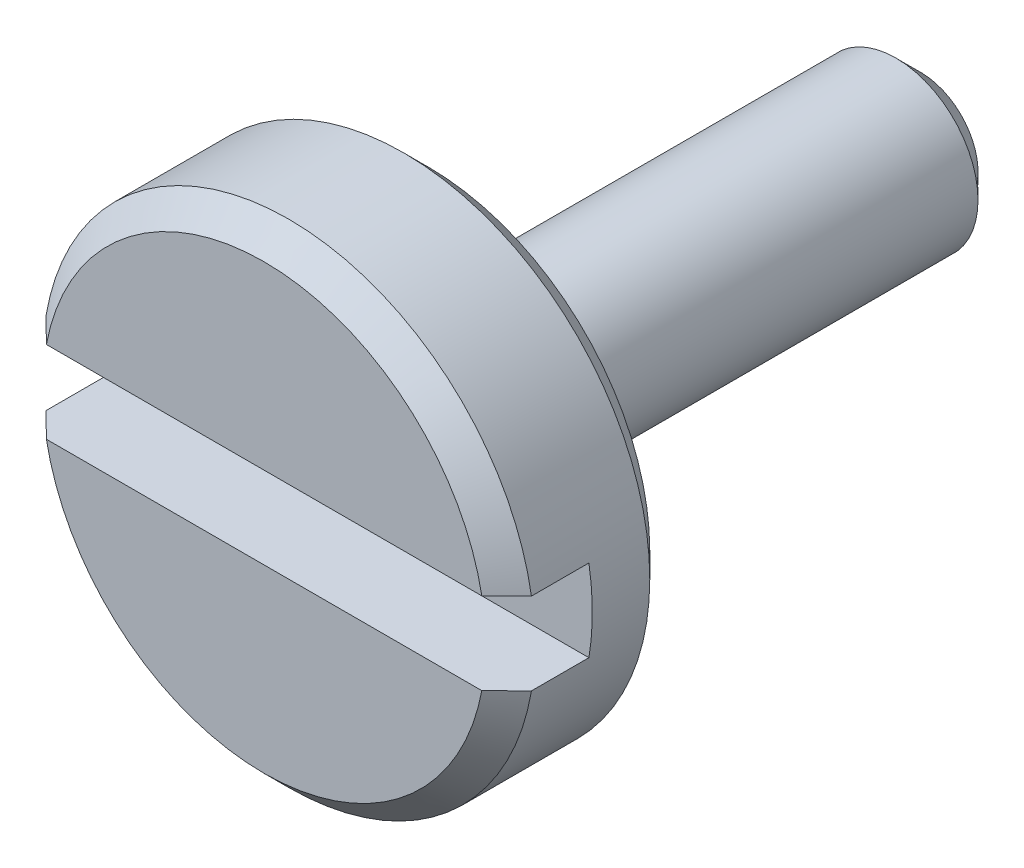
ISO-10303-21;
HEADER;
FILE_DESCRIPTION(('STEP AP214'),'2;1');
FILE_NAME('part.step','',(''),(''),'','','');
FILE_SCHEMA(('AUTOMOTIVE_DESIGN { 1 0 10303 214 1 1 1 1 }'));
ENDSEC;
DATA;
#1=APPLICATION_CONTEXT('core data for automotive mechanical design processes');
#2=APPLICATION_PROTOCOL_DEFINITION('international standard','automotive_design',2000,#1);
#3=PRODUCT_CONTEXT('',#1,'mechanical');
#4=PRODUCT('Part','Part','',(#3));
#5=PRODUCT_RELATED_PRODUCT_CATEGORY('part','',(#4));
#6=PRODUCT_DEFINITION_FORMATION('','',#4);
#7=PRODUCT_DEFINITION_CONTEXT('part definition',#1,'design');
#8=PRODUCT_DEFINITION('design','',#6,#7);
#9=PRODUCT_DEFINITION_SHAPE('','',#8);
#10=(LENGTH_UNIT() NAMED_UNIT(*) SI_UNIT(.MILLI.,.METRE.));
#11=(NAMED_UNIT(*) PLANE_ANGLE_UNIT() SI_UNIT($,.RADIAN.));
#12=(NAMED_UNIT(*) SI_UNIT($,.STERADIAN.) SOLID_ANGLE_UNIT());
#13=UNCERTAINTY_MEASURE_WITH_UNIT(LENGTH_MEASURE(1.E-05),#10,'distance_accuracy_value','');
#14=(GEOMETRIC_REPRESENTATION_CONTEXT(3) GLOBAL_UNCERTAINTY_ASSIGNED_CONTEXT((#13)) GLOBAL_UNIT_ASSIGNED_CONTEXT((#10,
#11,#12)) REPRESENTATION_CONTEXT('',''));
#15=CARTESIAN_POINT('',(0.,0.,0.));
#16=DIRECTION('',(0.,0.,1.));
#17=DIRECTION('',(1.,0.,0.));
#18=AXIS2_PLACEMENT_3D('',#15,#16,#17);
#19=CARTESIAN_POINT('',(0.,0.,-60.));
#20=DIRECTION('',(0.,0.,-1.));
#21=DIRECTION('',(-1.,0.,0.));
#22=AXIS2_PLACEMENT_3D('',#19,#20,#21);
#23=PLANE('',#22);
#24=CARTESIAN_POINT('',(0.,0.,-60.));
#25=DIRECTION('',(0.,0.,-1.));
#26=DIRECTION('',(-1.,0.,0.));
#27=AXIS2_PLACEMENT_3D('',#24,#25,#26);
#28=CIRCLE('',#27,7.00000000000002);
#29=CARTESIAN_POINT('',(-7.00000000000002,0.,-60.));
#30=VERTEX_POINT('',#29);
#31=EDGE_CURVE('E315',#30,#30,#28,.T.);
#32=ORIENTED_EDGE('',*,*,#31,.T.);
#33=EDGE_LOOP('',(#32));
#34=FACE_BOUND('',#33,.T.);
#35=DIRECTION('',(1.,0.,0.));
#36=VECTOR('',#35,1.);
#37=CARTESIAN_POINT('',(-2.42307692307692,0.,-60.));
#38=LINE('',#37,#36);
#39=CARTESIAN_POINT('',(-2.42307692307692,0.,-60.));
#40=VERTEX_POINT('',#39);
#41=CARTESIAN_POINT('',(-0.448717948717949,0.,-60.));
#42=VERTEX_POINT('',#41);
#43=EDGE_CURVE('E186',#40,#42,#38,.T.);
#44=ORIENTED_EDGE('',*,*,#43,.T.);
#45=DIRECTION('',(0.,1.,0.));
#46=VECTOR('',#45,1.);
#47=CARTESIAN_POINT('',(-0.448717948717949,0.,-60.));
#48=LINE('',#47,#46);
#49=CARTESIAN_POINT('',(-0.448717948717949,3.5,-60.));
#50=VERTEX_POINT('',#49);
#51=EDGE_CURVE('E49',#42,#50,#48,.T.);
#52=ORIENTED_EDGE('',*,*,#51,.T.);
#53=DIRECTION('',(-1.,0.,0.));
#54=VECTOR('',#53,1.);
#55=CARTESIAN_POINT('',(-0.448717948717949,3.5,-60.));
#56=LINE('',#55,#54);
#57=CARTESIAN_POINT('',(-2.42307692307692,3.5,-60.));
#58=VERTEX_POINT('',#57);
#59=EDGE_CURVE('E190',#50,#58,#56,.T.);
#60=ORIENTED_EDGE('',*,*,#59,.T.);
#61=DIRECTION('',(0.,-1.,0.));
#62=VECTOR('',#61,1.);
#63=CARTESIAN_POINT('',(-2.42307692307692,3.5,-60.));
#64=LINE('',#63,#62);
#65=CARTESIAN_POINT('',(-2.42307692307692,3.14102564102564,-60.));
#66=VERTEX_POINT('',#65);
#67=EDGE_CURVE('E609',#58,#66,#64,.T.);
#68=ORIENTED_EDGE('',*,*,#67,.T.);
#69=DIRECTION('',(1.,0.,0.));
#70=VECTOR('',#69,1.);
#71=CARTESIAN_POINT('',(-2.42307692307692,3.14102564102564,-60.));
#72=LINE('',#71,#70);
#73=CARTESIAN_POINT('',(-0.762820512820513,3.14102564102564,-60.));
#74=VERTEX_POINT('',#73);
#75=EDGE_CURVE('E611',#66,#74,#72,.T.);
#76=ORIENTED_EDGE('',*,*,#75,.T.);
#77=DIRECTION('',(0.,-1.,0.));
#78=VECTOR('',#77,1.);
#79=CARTESIAN_POINT('',(-0.762820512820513,3.14102564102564,-60.));
#80=LINE('',#79,#78);
#81=CARTESIAN_POINT('',(-0.762820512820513,2.06410256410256,-60.));
#82=VERTEX_POINT('',#81);
#83=EDGE_CURVE('E615',#74,#82,#80,.T.);
#84=ORIENTED_EDGE('',*,*,#83,.T.);
#85=DIRECTION('',(-1.,0.,0.));
#86=VECTOR('',#85,1.);
#87=CARTESIAN_POINT('',(-0.762820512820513,2.06410256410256,-60.));
#88=LINE('',#87,#86);
#89=CARTESIAN_POINT('',(-2.42307692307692,2.06410256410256,-60.));
#90=VERTEX_POINT('',#89);
#91=EDGE_CURVE('E622',#82,#90,#88,.T.);
#92=ORIENTED_EDGE('',*,*,#91,.T.);
#93=DIRECTION('',(0.,-1.,0.));
#94=VECTOR('',#93,1.);
#95=CARTESIAN_POINT('',(-2.42307692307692,2.06410256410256,-60.));
#96=LINE('',#95,#94);
#97=CARTESIAN_POINT('',(-2.42307692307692,1.70512820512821,-60.));
#98=VERTEX_POINT('',#97);
#99=EDGE_CURVE('E625',#90,#98,#96,.T.);
#100=ORIENTED_EDGE('',*,*,#99,.T.);
#101=DIRECTION('',(1.,0.,0.));
#102=VECTOR('',#101,1.);
#103=CARTESIAN_POINT('',(-2.42307692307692,1.70512820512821,-60.));
#104=LINE('',#103,#102);
#105=CARTESIAN_POINT('',(-0.762820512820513,1.70512820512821,-60.));
#106=VERTEX_POINT('',#105);
#107=EDGE_CURVE('E628',#98,#106,#104,.T.);
#108=ORIENTED_EDGE('',*,*,#107,.T.);
#109=DIRECTION('',(0.,-1.,0.));
#110=VECTOR('',#109,1.);
#111=CARTESIAN_POINT('',(-0.762820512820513,1.70512820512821,-60.));
#112=LINE('',#111,#110);
#113=CARTESIAN_POINT('',(-0.762820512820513,0.358974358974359,-60.));
#114=VERTEX_POINT('',#113);
#115=EDGE_CURVE('E585',#106,#114,#112,.T.);
#116=ORIENTED_EDGE('',*,*,#115,.T.);
#117=DIRECTION('',(-1.,0.,0.));
#118=VECTOR('',#117,1.);
#119=CARTESIAN_POINT('',(-0.762820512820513,0.358974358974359,-60.));
#120=LINE('',#119,#118);
#121=CARTESIAN_POINT('',(-2.42307692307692,0.358974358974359,-60.));
#122=VERTEX_POINT('',#121);
#123=EDGE_CURVE('E582',#114,#122,#120,.T.);
#124=ORIENTED_EDGE('',*,*,#123,.T.);
#125=DIRECTION('',(0.,-1.,0.));
#126=VECTOR('',#125,1.);
#127=CARTESIAN_POINT('',(-2.42307692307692,0.358974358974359,-60.));
#128=LINE('',#127,#126);
#129=EDGE_CURVE('E576',#122,#40,#128,.T.);
#130=ORIENTED_EDGE('',*,*,#129,.T.);
#131=EDGE_LOOP('',(#44,#52,#60,#68,#76,#84,#92,#100,#108,#116,#124,#130));
#132=FACE_BOUND('',#131,.T.);
#133=ADVANCED_FACE('F34',(#34,#132),#23,.T.);
#134=CARTESIAN_POINT('',(0.,0.,-60.));
#135=DIRECTION('',(0.,0.,1.));
#136=DIRECTION('',(1.,0.,0.));
#137=AXIS2_PLACEMENT_3D('',#134,#135,#136);
#138=CYLINDRICAL_SURFACE('',#137,10.);
#139=CARTESIAN_POINT('',(0.,0.,0.));
#140=DIRECTION('',(0.,0.,1.));
#141=DIRECTION('',(1.,0.,0.));
#142=AXIS2_PLACEMENT_3D('',#139,#140,#141);
#143=CIRCLE('',#142,10.);
#144=CARTESIAN_POINT('',(10.,0.,0.));
#145=VERTEX_POINT('',#144);
#146=EDGE_CURVE('E319',#145,#145,#143,.F.);
#147=ORIENTED_EDGE('',*,*,#146,.T.);
#148=EDGE_LOOP('',(#147));
#149=FACE_BOUND('',#148,.T.);
#150=CARTESIAN_POINT('',(0.,0.,-57.));
#151=DIRECTION('',(0.,0.,-1.));
#152=DIRECTION('',(-1.,0.,0.));
#153=AXIS2_PLACEMENT_3D('',#150,#151,#152);
#154=CIRCLE('',#153,10.);
#155=CARTESIAN_POINT('',(-10.,0.,-57.));
#156=VERTEX_POINT('',#155);
#157=EDGE_CURVE('E313',#156,#156,#154,.F.);
#158=ORIENTED_EDGE('',*,*,#157,.T.);
#159=EDGE_LOOP('',(#158));
#160=FACE_BOUND('',#159,.T.);
#161=DIRECTION('',(0.,0.,1.));
#162=VECTOR('',#161,1.);
#163=CARTESIAN_POINT('',(-9.92156741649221,-1.25,-60.));
#164=LINE('',#163,#162);
#165=CARTESIAN_POINT('',(-9.92156741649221,-1.25,-51.1866580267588));
#166=VERTEX_POINT('',#165);
#167=CARTESIAN_POINT('',(-9.92156741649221,-1.25,-37.0592673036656));
#168=VERTEX_POINT('',#167);
#169=EDGE_CURVE('E11',#166,#168,#164,.T.);
#170=ORIENTED_EDGE('',*,*,#169,.F.);
#171=CARTESIAN_POINT('',(-9.92156741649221,-1.25,-51.1866580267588));
#172=CARTESIAN_POINT('',(-9.93460745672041,-1.14651016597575,-51.1997216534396));
#173=CARTESIAN_POINT('',(-9.94604927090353,-1.04262221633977,-51.2111190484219));
#174=CARTESIAN_POINT('',(-9.96569126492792,-0.834233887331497,-51.2306135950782));
#175=CARTESIAN_POINT('',(-9.97389150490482,-0.729733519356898,-51.238710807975));
#176=CARTESIAN_POINT('',(-9.9934586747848,-0.417245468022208,-51.2579985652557));
#177=CARTESIAN_POINT('',(-10.,-0.208622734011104,-51.2643910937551));
#178=CARTESIAN_POINT('',(-10.,0.208622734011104,-51.2643910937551));
#179=CARTESIAN_POINT('',(-9.9934586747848,0.417245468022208,-51.2579985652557));
#180=CARTESIAN_POINT('',(-9.97389150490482,0.729733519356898,-51.238710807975));
#181=CARTESIAN_POINT('',(-9.96569126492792,0.834233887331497,-51.2306135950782));
#182=CARTESIAN_POINT('',(-9.94604927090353,1.04262221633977,-51.2111190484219));
#183=CARTESIAN_POINT('',(-9.93460745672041,1.14651016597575,-51.1997216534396));
#184=CARTESIAN_POINT('',(-9.92156741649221,1.25,-51.1866580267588));
#185=B_SPLINE_CURVE_WITH_KNOTS('',3,(#171,#172,#173,#174,#175,#176,#177,#178,#179,#180,#181,
#182,#183,#184),.UNSPECIFIED.,.F.,.F.,(4,2,2,2,2,2,4),(0.,0.315316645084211,0.630627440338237,
1.25624528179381,1.88186312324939,2.19717391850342,2.51249056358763),.UNSPECIFIED.);
#186=CARTESIAN_POINT('',(-9.92156741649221,1.25,-51.1866580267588));
#187=VERTEX_POINT('',#186);
#188=EDGE_CURVE('E42',#166,#187,#185,.T.);
#189=ORIENTED_EDGE('',*,*,#188,.T.);
#190=DIRECTION('',(0.,0.,1.));
#191=VECTOR('',#190,1.);
#192=CARTESIAN_POINT('',(-9.92156741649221,1.25,-60.));
#193=LINE('',#192,#191);
#194=CARTESIAN_POINT('',(-9.92156741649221,1.25,-37.0592673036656));
#195=VERTEX_POINT('',#194);
#196=EDGE_CURVE('E312',#187,#195,#193,.T.);
#197=ORIENTED_EDGE('',*,*,#196,.T.);
#198=CARTESIAN_POINT('',(-9.92156741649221,1.25,-37.0592673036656));
#199=CARTESIAN_POINT('',(-9.93460745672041,1.14651016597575,-37.0462036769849));
#200=CARTESIAN_POINT('',(-9.94604927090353,1.04262221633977,-37.0348062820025));
#201=CARTESIAN_POINT('',(-9.96569126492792,0.834233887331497,-37.0153117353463));
#202=CARTESIAN_POINT('',(-9.97389150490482,0.729733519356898,-37.0072145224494));
#203=CARTESIAN_POINT('',(-9.9934586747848,0.417245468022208,-36.9879267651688));
#204=CARTESIAN_POINT('',(-10.,0.208622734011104,-36.9815342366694));
#205=CARTESIAN_POINT('',(-10.,-0.208622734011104,-36.9815342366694));
#206=CARTESIAN_POINT('',(-9.9934586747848,-0.417245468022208,-36.9879267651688));
#207=CARTESIAN_POINT('',(-9.97389150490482,-0.729733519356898,-37.0072145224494));
#208=CARTESIAN_POINT('',(-9.96569126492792,-0.834233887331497,-37.0153117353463));
#209=CARTESIAN_POINT('',(-9.94604927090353,-1.04262221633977,-37.0348062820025));
#210=CARTESIAN_POINT('',(-9.93460745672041,-1.14651016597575,-37.0462036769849));
#211=CARTESIAN_POINT('',(-9.92156741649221,-1.25,-37.0592673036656));
#212=B_SPLINE_CURVE_WITH_KNOTS('',3,(#198,#199,#200,#201,#202,#203,#204,#205,#206,#207,#208,
#209,#210,#211),.UNSPECIFIED.,.F.,.F.,(4,2,2,2,2,2,4),(0.,0.315316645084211,0.630627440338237,
1.25624528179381,1.88186312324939,2.19717391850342,2.51249056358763),.UNSPECIFIED.);
#213=EDGE_CURVE('E299',#195,#168,#212,.T.);
#214=ORIENTED_EDGE('',*,*,#213,.T.);
#215=EDGE_LOOP('',(#170,#189,#197,#214));
#216=FACE_BOUND('',#215,.T.);
#217=ADVANCED_FACE('F270',(#149,#160,#216),#138,.T.);
#218=CARTESIAN_POINT('',(0.,0.,0.));
#219=DIRECTION('',(0.,0.,1.));
#220=DIRECTION('',(1.,0.,0.));
#221=AXIS2_PLACEMENT_3D('',#218,#219,#220);
#222=PLANE('',#221);
#223=CARTESIAN_POINT('',(0.,0.,0.));
#224=DIRECTION('',(0.,0.,1.));
#225=DIRECTION('',(1.,0.,0.));
#226=AXIS2_PLACEMENT_3D('',#223,#224,#225);
#227=CIRCLE('',#226,27.);
#228=CARTESIAN_POINT('',(27.,0.,0.));
#229=VERTEX_POINT('',#228);
#230=EDGE_CURVE('E234',#229,#229,#227,.F.);
#231=ORIENTED_EDGE('',*,*,#230,.T.);
#232=EDGE_LOOP('',(#231));
#233=FACE_BOUND('',#232,.T.);
#234=ORIENTED_EDGE('',*,*,#146,.F.);
#235=EDGE_LOOP('',(#234));
#236=FACE_BOUND('',#235,.T.);
#237=ADVANCED_FACE('F268',(#233,#236),#222,.F.);
#238=CARTESIAN_POINT('',(0.,0.,20.));
#239=DIRECTION('',(0.,0.,1.));
#240=DIRECTION('',(1.,0.,0.));
#241=AXIS2_PLACEMENT_3D('',#238,#239,#240);
#242=PLANE('',#241);
#243=DIRECTION('',(-1.,0.,0.));
#244=VECTOR('',#243,1.);
#245=CARTESIAN_POINT('',(-31.8396190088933,5.,20.));
#246=LINE('',#245,#244);
#247=CARTESIAN_POINT('',(26.5329983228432,5.,20.));
#248=VERTEX_POINT('',#247);
#249=CARTESIAN_POINT('',(-26.5329983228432,5.,20.));
#250=VERTEX_POINT('',#249);
#251=EDGE_CURVE('E206',#248,#250,#246,.T.);
#252=ORIENTED_EDGE('',*,*,#251,.F.);
#253=CARTESIAN_POINT('',(0.,0.,20.));
#254=DIRECTION('',(0.,0.,1.));
#255=DIRECTION('',(1.,0.,0.));
#256=AXIS2_PLACEMENT_3D('',#253,#254,#255);
#257=CIRCLE('',#256,27.);
#258=EDGE_CURVE('E224',#248,#250,#257,.T.);
#259=ORIENTED_EDGE('',*,*,#258,.T.);
#260=EDGE_LOOP('',(#252,#259));
#261=FACE_BOUND('',#260,.T.);
#262=ADVANCED_FACE('F267',(#261),#242,.T.);
#263=CARTESIAN_POINT('',(0.,0.,20.));
#264=DIRECTION('',(0.,0.,-1.));
#265=DIRECTION('',(-1.,0.,0.));
#266=AXIS2_PLACEMENT_3D('',#263,#264,#265);
#267=CONICAL_SURFACE('',#266,27.,0.785398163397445);
#268=CARTESIAN_POINT('',(65.8556355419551,5.,-19.0451719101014));
#269=CARTESIAN_POINT('',(64.68929328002,5.,-17.8821787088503));
#270=CARTESIAN_POINT('',(63.5228644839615,5.,-16.7192722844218));
#271=CARTESIAN_POINT('',(61.1897976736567,5.,-14.393669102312));
#272=CARTESIAN_POINT('',(60.0231596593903,5.,-13.2309723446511));
#273=CARTESIAN_POINT('',(56.5227931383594,5.,-9.74316661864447));
#274=CARTESIAN_POINT('',(54.1886968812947,5.,-7.41842669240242));
#275=CARTESIAN_POINT('',(49.5170329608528,5.,-2.7683210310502));
#276=CARTESIAN_POINT('',(47.1794640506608,5.,-0.442956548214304));
#277=CARTESIAN_POINT('',(43.6715021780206,5.,3.04339004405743));
#278=CARTESIAN_POINT('',(42.5019339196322,5.,4.20520193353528));
#279=CARTESIAN_POINT('',(40.1620907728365,5.,6.52811218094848));
#280=CARTESIAN_POINT('',(38.9918158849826,5.,7.68921053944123));
#281=CARTESIAN_POINT('',(36.7013079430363,5.,9.95996136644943));
#282=CARTESIAN_POINT('',(35.5811139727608,5.,11.0696532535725));
#283=CARTESIAN_POINT('',(33.3396170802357,5.,13.2879231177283));
#284=CARTESIAN_POINT('',(32.2183141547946,5.,14.3965010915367));
#285=CARTESIAN_POINT('',(29.9740960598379,5.,16.6122623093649));
#286=CARTESIAN_POINT('',(28.851180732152,5.,17.7194453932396));
#287=CARTESIAN_POINT('',(26.6032702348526,5.,19.931675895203));
#288=CARTESIAN_POINT('',(25.4782750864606,5.,21.0367233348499));
#289=CARTESIAN_POINT('',(23.2258575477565,5.,23.2431345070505));
#290=CARTESIAN_POINT('',(22.0984367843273,5.,24.3444998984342));
#291=CARTESIAN_POINT('',(20.4037555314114,5.,25.9929457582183));
#292=CARTESIAN_POINT('',(19.8382583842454,5.,26.5418386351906));
#293=CARTESIAN_POINT('',(18.7057501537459,5.,27.6380584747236));
#294=CARTESIAN_POINT('',(18.1387390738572,5.,28.1853854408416));
#295=CARTESIAN_POINT('',(17.0028555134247,5.,29.2778978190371));
#296=CARTESIAN_POINT('',(16.4339833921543,5.,29.8230836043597));
#297=CARTESIAN_POINT('',(15.2936191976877,5.,30.9107058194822));
#298=CARTESIAN_POINT('',(14.7221271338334,5.,31.4531422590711));
#299=CARTESIAN_POINT('',(13.5755888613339,5.,32.5341815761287));
#300=CARTESIAN_POINT('',(13.0005428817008,5.,33.0727846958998));
#301=CARTESIAN_POINT('',(12.1341242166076,5.,33.8765296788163));
#302=CARTESIAN_POINT('',(11.8446789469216,5.,34.1437490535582));
#303=CARTESIAN_POINT('',(11.2642175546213,5.,34.6764753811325));
#304=CARTESIAN_POINT('',(10.973201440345,5.,34.9419823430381));
#305=CARTESIAN_POINT('',(10.5190691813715,5.,35.3532789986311));
#306=CARTESIAN_POINT('',(10.3566207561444,5.,35.4998061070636));
#307=CARTESIAN_POINT('',(10.0310484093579,5.,35.7921104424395));
#308=CARTESIAN_POINT('',(9.86792448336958,5.,35.937887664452));
#309=CARTESIAN_POINT('',(9.54089744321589,5.,36.2285975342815));
#310=CARTESIAN_POINT('',(9.37699425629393,5.,36.3735301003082));
#311=CARTESIAN_POINT('',(9.04831656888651,5.,36.6624035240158));
#312=CARTESIAN_POINT('',(8.88354206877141,5.,36.8063443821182));
#313=CARTESIAN_POINT('',(8.38538551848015,5.,37.2384859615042));
#314=CARTESIAN_POINT('',(8.05048455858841,5.,37.5249412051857));
#315=CARTESIAN_POINT('',(7.37540456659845,5.,38.091423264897));
#316=CARTESIAN_POINT('',(7.03522692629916,5.,38.3714517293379));
#317=CARTESIAN_POINT('',(6.51816738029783,5.,38.7856310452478));
#318=CARTESIAN_POINT('',(6.34403051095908,5.,38.9232073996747));
#319=CARTESIAN_POINT('',(5.99353583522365,5.,39.1954972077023));
#320=CARTESIAN_POINT('',(5.81717809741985,5.,39.3302107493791));
#321=CARTESIAN_POINT('',(5.46159323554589,5.,39.5962799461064));
#322=CARTESIAN_POINT('',(5.28236277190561,5.,39.7276311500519));
#323=CARTESIAN_POINT('',(4.92073426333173,5.,39.9859001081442));
#324=CARTESIAN_POINT('',(4.73833634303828,5.,40.1128180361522));
#325=CARTESIAN_POINT('',(4.37091006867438,5.,40.3602322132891));
#326=CARTESIAN_POINT('',(4.18590597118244,5.,40.4807643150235));
#327=CARTESIAN_POINT('',(3.81135724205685,5.,40.7146966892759));
#328=CARTESIAN_POINT('',(3.62181166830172,5.,40.8280954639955));
#329=CARTESIAN_POINT('',(3.23781372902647,5.,41.0453031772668));
#330=CARTESIAN_POINT('',(3.04337312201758,5.,41.149132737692));
#331=CARTESIAN_POINT('',(2.648453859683,5.,41.3444823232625));
#332=CARTESIAN_POINT('',(2.44797898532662,5.,41.4360098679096));
#333=CARTESIAN_POINT('',(2.09118241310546,5.,41.5821043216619));
#334=CARTESIAN_POINT('',(1.93631281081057,5.,41.6401970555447));
#335=CARTESIAN_POINT('',(1.62280468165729,5.,41.7453167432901));
#336=CARTESIAN_POINT('',(1.4641660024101,5.,41.7923432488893));
#337=CARTESIAN_POINT('',(1.14419944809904,5.,41.8730754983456));
#338=CARTESIAN_POINT('',(0.982885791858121,5.,41.9068367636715));
#339=CARTESIAN_POINT('',(0.657825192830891,5.,41.9594604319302));
#340=CARTESIAN_POINT('',(0.494078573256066,5.,41.978324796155));
#341=CARTESIAN_POINT('',(0.16391020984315,5.,42.0000512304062));
#342=CARTESIAN_POINT('',(-0.00252208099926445,5.,42.0027564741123));
#343=CARTESIAN_POINT('',(-0.334816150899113,5.,41.9915552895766));
#344=CARTESIAN_POINT('',(-0.500677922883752,5.,41.9776486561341));
#345=CARTESIAN_POINT('',(-0.830782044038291,5.,41.9341014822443));
#346=CARTESIAN_POINT('',(-0.99501820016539,5.,41.9044148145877));
#347=CARTESIAN_POINT('',(-1.32031294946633,5.,41.83104631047));
#348=CARTESIAN_POINT('',(-1.48137078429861,5.,41.7873611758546));
#349=CARTESIAN_POINT('',(-1.88086272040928,5.,41.662821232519));
#350=CARTESIAN_POINT('',(-2.11691618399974,5.,41.5743682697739));
#351=CARTESIAN_POINT('',(-2.58043788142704,5.,41.377322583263));
#352=CARTESIAN_POINT('',(-2.80789931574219,5.,41.2687142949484));
#353=CARTESIAN_POINT('',(-3.14380644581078,5.,41.094549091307));
#354=CARTESIAN_POINT('',(-3.25514910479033,5.,41.0344645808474));
#355=CARTESIAN_POINT('',(-3.47606041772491,5.,40.9111096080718));
#356=CARTESIAN_POINT('',(-3.58562905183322,5.,40.8478391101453));
#357=CARTESIAN_POINT('',(-3.80309504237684,5.,40.718607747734));
#358=CARTESIAN_POINT('',(-3.91099312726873,5.,40.6526481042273));
#359=CARTESIAN_POINT('',(-4.12531480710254,5.,40.5183907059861));
#360=CARTESIAN_POINT('',(-4.23173846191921,5.,40.4500930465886));
#361=CARTESIAN_POINT('',(-4.58975559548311,5.,40.2155017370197));
#362=CARTESIAN_POINT('',(-4.83826444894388,5.,40.0444941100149));
#363=CARTESIAN_POINT('',(-5.32945766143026,5.,39.6942796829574));
#364=CARTESIAN_POINT('',(-5.57214066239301,5.,39.515070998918));
#365=CARTESIAN_POINT('',(-6.0530876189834,5.,39.1504602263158));
#366=CARTESIAN_POINT('',(-6.29134803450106,5.,38.9650534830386));
#367=CARTESIAN_POINT('',(-6.76419305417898,5.,38.5896689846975));
#368=CARTESIAN_POINT('',(-6.99877797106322,5.,38.3996916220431));
#369=CARTESIAN_POINT('',(-7.46559346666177,5.,38.0157116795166));
#370=CARTESIAN_POINT('',(-7.697816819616,5.,37.8217003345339));
#371=CARTESIAN_POINT('',(-8.15988097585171,5.,37.4308577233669));
#372=CARTESIAN_POINT('',(-8.38972173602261,5.,37.234026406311));
#373=CARTESIAN_POINT('',(-8.84734688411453,5.,36.8381906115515));
#374=CARTESIAN_POINT('',(-9.07513212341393,5.,36.6391871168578));
#375=CARTESIAN_POINT('',(-9.52908055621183,5.,36.2393373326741));
#376=CARTESIAN_POINT('',(-9.75524373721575,5.,36.0384910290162));
#377=CARTESIAN_POINT('',(-10.4325949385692,5.,35.432897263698));
#378=CARTESIAN_POINT('',(-10.8817485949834,5.,35.025874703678));
#379=CARTESIAN_POINT('',(-11.776212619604,5.,34.2075509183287));
#380=CARTESIAN_POINT('',(-12.2215225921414,5.,33.7962492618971));
#381=CARTESIAN_POINT('',(-13.1085597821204,5.,32.971176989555));
#382=CARTESIAN_POINT('',(-13.5502914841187,5.,32.5574111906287));
#383=CARTESIAN_POINT('',(-14.4315399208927,5.,31.7275608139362));
#384=CARTESIAN_POINT('',(-14.8710567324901,5.,31.3114763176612));
#385=CARTESIAN_POINT('',(-15.7442912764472,5.,30.4813888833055));
#386=CARTESIAN_POINT('',(-16.1780248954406,5.,30.0674026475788));
#387=CARTESIAN_POINT('',(-17.0441516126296,5.,29.238029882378));
#388=CARTESIAN_POINT('',(-17.4765447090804,5.,28.8226433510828));
#389=CARTESIAN_POINT('',(-18.7721181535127,5.,27.5748071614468));
#390=CARTESIAN_POINT('',(-19.6336878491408,5.,26.7406854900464));
#391=CARTESIAN_POINT('',(-21.3539494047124,5.,25.0694293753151));
#392=CARTESIAN_POINT('',(-22.2126411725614,5.,24.2322948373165));
#393=CARTESIAN_POINT('',(-23.9279511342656,5.,22.5559030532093));
#394=CARTESIAN_POINT('',(-24.7845693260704,5.,21.7166458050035));
#395=CARTESIAN_POINT('',(-26.4968110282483,5.,20.036057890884));
#396=CARTESIAN_POINT('',(-27.352433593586,5.,19.1947262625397));
#397=CARTESIAN_POINT('',(-29.0625198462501,5.,17.5108850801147));
#398=CARTESIAN_POINT('',(-29.9169835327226,5.,16.6683755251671));
#399=CARTESIAN_POINT('',(-32.4790160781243,5.,14.1395254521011));
#400=CARTESIAN_POINT('',(-34.1852538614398,5.,12.4518365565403));
#401=CARTESIAN_POINT('',(-37.591392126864,5.,9.07825999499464));
#402=CARTESIAN_POINT('',(-39.2912979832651,5.,7.39237775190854));
#403=CARTESIAN_POINT('',(-42.6895996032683,5.,4.01907843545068));
#404=CARTESIAN_POINT('',(-44.387995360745,5.,2.3316613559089));
#405=CARTESIAN_POINT('',(-47.7834450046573,5.,-1.04398210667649));
#406=CARTESIAN_POINT('',(-49.480499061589,5.,-2.73220831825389));
#407=CARTESIAN_POINT('',(-52.8738193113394,5.,-6.10944904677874));
#408=CARTESIAN_POINT('',(-54.5700855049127,5.,-7.798463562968));
#409=CARTESIAN_POINT('',(-57.0650936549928,5.,-10.2836796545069));
#410=CARTESIAN_POINT('',(-57.8640668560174,5.,-11.0796491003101));
#411=CARTESIAN_POINT('',(-59.461916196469,5.,-12.6717258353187));
#412=CARTESIAN_POINT('',(-60.2607923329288,5.,-13.467833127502));
#413=CARTESIAN_POINT('',(-61.8590598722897,5.,-15.0607688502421));
#414=CARTESIAN_POINT('',(-62.6584511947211,5.,-15.857597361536));
#415=CARTESIAN_POINT('',(-64.2571205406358,5.,-17.4513274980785));
#416=CARTESIAN_POINT('',(-65.0563985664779,5.,-18.2482291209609));
#417=CARTESIAN_POINT('',(-65.8556355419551,5.,-19.0451719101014));
#418=B_SPLINE_CURVE_WITH_KNOTS('',3,(#268,#269,#270,#271,#272,#273,#274,#275,#276,#277,#278,
#279,#280,#281,#282,#283,#284,#285,#286,#287,#288,#289,#290,#291,#292,#293,#294,#295,#296,#297,
#298,#299,#300,#301,#302,#303,#304,#305,#306,#307,#308,#309,#310,#311,#312,#313,#314,#315,#316,
#317,#318,#319,#320,#321,#322,#323,#324,#325,#326,#327,#328,#329,#330,#331,#332,#333,#334,#335,
#336,#337,#338,#339,#340,#341,#342,#343,#344,#345,#346,#347,#348,#349,#350,#351,#352,#353,#354,
#355,#356,#357,#358,#359,#360,#361,#362,#363,#364,#365,#366,#367,#368,#369,#370,#371,#372,#373,
#374,#375,#376,#377,#378,#379,#380,#381,#382,#383,#384,#385,#386,#387,#388,#389,#390,#391,#392,
#393,#394,#395,#396,#397,#398,#399,#400,#401,#402,#403,#404,#405,#406,#407,#408,#409,#410,#411,
#412,#413,#414,#415,#416,#417),.UNSPECIFIED.,.F.,.F.,(4,2,2,2,2,2,2,2,2,2,2,2,2,2,2,2,2,2,2,2,2,
2,2,2,2,2,2,2,2,2,2,2,2,2,2,2,2,2,2,2,2,2,2,2,2,2,2,2,2,2,2,2,2,2,2,2,2,2,2,2,2,2,2,2,2,2,2,2,2,
2,2,2,2,2,4),(0.,4.94127181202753,9.88254410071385,19.7654476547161,29.6570558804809,
34.6026871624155,39.5483145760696,44.2786686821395,49.0090364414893,53.7399051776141,
58.4707259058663,63.1990074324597,65.5632458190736,67.9274788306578,70.2912795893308,
72.6550719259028,75.0187134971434,76.2005134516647,77.3823071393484,78.0386109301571,
78.6949190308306,79.3512896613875,80.0076600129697,81.3297035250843,82.6514040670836,
83.3171575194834,83.9828904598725,84.6494633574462,85.3160100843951,85.9782975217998,
86.6407235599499,87.3016869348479,87.9622444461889,88.4581264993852,88.954028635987,
89.4478324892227,89.9415713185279,90.440094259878,90.9386233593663,91.4386178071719,
91.9387301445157,92.6936197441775,93.449094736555,93.8286136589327,94.2081368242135,
94.5874895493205,94.9668268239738,95.8715470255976,96.7764761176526,97.6821007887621,
98.5876479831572,99.4954265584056,100.403221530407,101.310621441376,102.218028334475,
104.036405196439,105.854967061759,107.670709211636,109.486387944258,111.285157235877,
113.083928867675,116.681492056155,120.279169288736,123.876850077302,127.476759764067,
131.076672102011,138.276381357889,145.458783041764,152.641213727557,159.822501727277,
167.003782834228,170.387173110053,173.770648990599,177.156746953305,180.542759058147),.UNSPECIFIED.);
#419=CARTESIAN_POINT('',(29.5803989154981,5.,17.));
#420=VERTEX_POINT('',#419);
#421=EDGE_CURVE('E323',#420,#248,#418,.T.);
#422=ORIENTED_EDGE('',*,*,#421,.F.);
#423=CARTESIAN_POINT('',(0.,0.,17.));
#424=DIRECTION('',(0.,0.,1.));
#425=DIRECTION('',(1.,0.,0.));
#426=AXIS2_PLACEMENT_3D('',#423,#424,#425);
#427=CIRCLE('',#426,30.);
#428=CARTESIAN_POINT('',(-29.5803989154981,5.,17.));
#429=VERTEX_POINT('',#428);
#430=EDGE_CURVE('E227',#429,#420,#427,.F.);
#431=ORIENTED_EDGE('',*,*,#430,.F.);
#432=EDGE_CURVE('E245',#250,#429,#418,.T.);
#433=ORIENTED_EDGE('',*,*,#432,.F.);
#434=ORIENTED_EDGE('',*,*,#258,.F.);
#435=EDGE_LOOP('',(#422,#431,#433,#434));
#436=FACE_BOUND('',#435,.T.);
#437=ADVANCED_FACE('F273',(#436),#267,.T.);
#438=CARTESIAN_POINT('',(0.,0.,20.));
#439=DIRECTION('',(0.,0.,-1.));
#440=DIRECTION('',(-1.,0.,0.));
#441=AXIS2_PLACEMENT_3D('',#438,#439,#440);
#442=CYLINDRICAL_SURFACE('',#441,30.);
#443=CARTESIAN_POINT('',(0.,0.,10.));
#444=DIRECTION('',(0.,0.,1.));
#445=DIRECTION('',(1.,0.,0.));
#446=AXIS2_PLACEMENT_3D('',#443,#444,#445);
#447=CIRCLE('',#446,30.);
#448=CARTESIAN_POINT('',(-29.5803989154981,5.,10.));
#449=VERTEX_POINT('',#448);
#450=CARTESIAN_POINT('',(-29.5803989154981,-5.,10.));
#451=VERTEX_POINT('',#450);
#452=EDGE_CURVE('E321',#449,#451,#447,.T.);
#453=ORIENTED_EDGE('',*,*,#452,.F.);
#454=DIRECTION('',(0.,0.,-1.));
#455=VECTOR('',#454,1.);
#456=CARTESIAN_POINT('',(-29.5803989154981,5.,20.));
#457=LINE('',#456,#455);
#458=EDGE_CURVE('E217',#449,#429,#457,.F.);
#459=ORIENTED_EDGE('',*,*,#458,.T.);
#460=ORIENTED_EDGE('',*,*,#430,.T.);
#461=DIRECTION('',(0.,0.,-1.));
#462=VECTOR('',#461,1.);
#463=CARTESIAN_POINT('',(29.5803989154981,5.,20.));
#464=LINE('',#463,#462);
#465=CARTESIAN_POINT('',(29.5803989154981,5.,10.));
#466=VERTEX_POINT('',#465);
#467=EDGE_CURVE('E220',#420,#466,#464,.T.);
#468=ORIENTED_EDGE('',*,*,#467,.T.);
#469=CARTESIAN_POINT('',(29.5803989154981,-5.,10.));
#470=VERTEX_POINT('',#469);
#471=EDGE_CURVE('E322',#470,#466,#447,.T.);
#472=ORIENTED_EDGE('',*,*,#471,.F.);
#473=DIRECTION('',(0.,0.,-1.));
#474=VECTOR('',#473,1.);
#475=CARTESIAN_POINT('',(29.5803989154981,-5.,20.));
#476=LINE('',#475,#474);
#477=CARTESIAN_POINT('',(29.5803989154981,-5.,17.));
#478=VERTEX_POINT('',#477);
#479=EDGE_CURVE('E209',#470,#478,#476,.F.);
#480=ORIENTED_EDGE('',*,*,#479,.T.);
#481=CARTESIAN_POINT('',(-29.5803989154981,-5.,17.));
#482=VERTEX_POINT('',#481);
#483=EDGE_CURVE('E228',#478,#482,#427,.F.);
#484=ORIENTED_EDGE('',*,*,#483,.T.);
#485=DIRECTION('',(0.,0.,-1.));
#486=VECTOR('',#485,1.);
#487=CARTESIAN_POINT('',(-29.5803989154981,-5.,20.));
#488=LINE('',#487,#486);
#489=EDGE_CURVE('E214',#482,#451,#488,.T.);
#490=ORIENTED_EDGE('',*,*,#489,.T.);
#491=EDGE_LOOP('',(#453,#459,#460,#468,#472,#480,#484,#490));
#492=FACE_BOUND('',#491,.T.);
#493=CARTESIAN_POINT('',(0.,0.,2.99999999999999));
#494=DIRECTION('',(0.,0.,1.));
#495=DIRECTION('',(1.,0.,0.));
#496=AXIS2_PLACEMENT_3D('',#493,#494,#495);
#497=CIRCLE('',#496,30.);
#498=CARTESIAN_POINT('',(30.,0.,2.99999999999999));
#499=VERTEX_POINT('',#498);
#500=EDGE_CURVE('E231',#499,#499,#497,.T.);
#501=ORIENTED_EDGE('',*,*,#500,.T.);
#502=EDGE_LOOP('',(#501));
#503=FACE_BOUND('',#502,.T.);
#504=ADVANCED_FACE('F265',(#492,#503),#442,.T.);
#505=DIRECTION('',(1.,0.,0.));
#506=VECTOR('',#505,1.);
#507=CARTESIAN_POINT('',(-31.8396190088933,-5.,20.));
#508=LINE('',#507,#506);
#509=CARTESIAN_POINT('',(-26.5329983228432,-5.,20.));
#510=VERTEX_POINT('',#509);
#511=CARTESIAN_POINT('',(26.5329983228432,-5.,20.));
#512=VERTEX_POINT('',#511);
#513=EDGE_CURVE('E200',#510,#512,#508,.T.);
#514=ORIENTED_EDGE('',*,*,#513,.F.);
#515=EDGE_CURVE('E223',#510,#512,#257,.T.);
#516=ORIENTED_EDGE('',*,*,#515,.T.);
#517=EDGE_LOOP('',(#514,#516));
#518=FACE_BOUND('',#517,.T.);
#519=ADVANCED_FACE('F262',(#518),#242,.T.);
#520=CARTESIAN_POINT('',(-65.8556355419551,-5.,-19.0451719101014));
#521=CARTESIAN_POINT('',(-64.68929328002,-5.,-17.8821787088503));
#522=CARTESIAN_POINT('',(-63.5228644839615,-5.,-16.7192722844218));
#523=CARTESIAN_POINT('',(-61.1897976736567,-5.,-14.393669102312));
#524=CARTESIAN_POINT('',(-60.0231596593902,-5.,-13.2309723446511));
#525=CARTESIAN_POINT('',(-56.5227931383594,-5.,-9.74316661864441));
#526=CARTESIAN_POINT('',(-54.1886968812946,-5.,-7.41842669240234));
#527=CARTESIAN_POINT('',(-49.5170329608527,-5.,-2.76832103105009));
#528=CARTESIAN_POINT('',(-47.1794640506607,-5.,-0.442956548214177));
#529=CARTESIAN_POINT('',(-43.6715021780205,-5.,3.04339004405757));
#530=CARTESIAN_POINT('',(-42.5019339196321,-5.,4.20520193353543));
#531=CARTESIAN_POINT('',(-40.1620907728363,-5.,6.52811218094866));
#532=CARTESIAN_POINT('',(-38.9918158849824,-5.,7.6892105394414));
#533=CARTESIAN_POINT('',(-36.7013079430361,-5.,9.95996136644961));
#534=CARTESIAN_POINT('',(-35.5811139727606,-5.,11.0696532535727));
#535=CARTESIAN_POINT('',(-33.3396170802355,-5.,13.2879231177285));
#536=CARTESIAN_POINT('',(-32.2183141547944,-5.,14.3965010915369));
#537=CARTESIAN_POINT('',(-29.9740960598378,-5.,16.612262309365));
#538=CARTESIAN_POINT('',(-28.8511807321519,-5.,17.7194453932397));
#539=CARTESIAN_POINT('',(-26.6032702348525,-5.,19.9316758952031));
#540=CARTESIAN_POINT('',(-25.4782750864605,-5.,21.03672333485));
#541=CARTESIAN_POINT('',(-23.2258575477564,-5.,23.2431345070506));
#542=CARTESIAN_POINT('',(-22.0984367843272,-5.,24.3444998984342));
#543=CARTESIAN_POINT('',(-20.4037555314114,-5.,25.9929457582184));
#544=CARTESIAN_POINT('',(-19.8382583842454,-5.,26.5418386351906));
#545=CARTESIAN_POINT('',(-18.7057501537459,-5.,27.6380584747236));
#546=CARTESIAN_POINT('',(-18.1387390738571,-5.,28.1853854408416));
#547=CARTESIAN_POINT('',(-17.0028555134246,-5.,29.2778978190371));
#548=CARTESIAN_POINT('',(-16.4339833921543,-5.,29.8230836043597));
#549=CARTESIAN_POINT('',(-15.2936191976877,-5.,30.9107058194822));
#550=CARTESIAN_POINT('',(-14.7221271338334,-5.,31.4531422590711));
#551=CARTESIAN_POINT('',(-13.5755888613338,-5.,32.5341815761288));
#552=CARTESIAN_POINT('',(-13.0005428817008,-5.,33.0727846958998));
#553=CARTESIAN_POINT('',(-12.1341242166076,-5.,33.8765296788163));
#554=CARTESIAN_POINT('',(-11.8446789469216,-5.,34.1437490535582));
#555=CARTESIAN_POINT('',(-11.2642175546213,-5.,34.6764753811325));
#556=CARTESIAN_POINT('',(-10.973201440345,-5.,34.9419823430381));
#557=CARTESIAN_POINT('',(-10.5190691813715,-5.,35.3532789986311));
#558=CARTESIAN_POINT('',(-10.3566207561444,-5.,35.4998061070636));
#559=CARTESIAN_POINT('',(-10.0310484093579,-5.,35.7921104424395));
#560=CARTESIAN_POINT('',(-9.86792448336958,-5.,35.937887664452));
#561=CARTESIAN_POINT('',(-9.5408974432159,-5.,36.2285975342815));
#562=CARTESIAN_POINT('',(-9.37699425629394,-5.,36.3735301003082));
#563=CARTESIAN_POINT('',(-9.04831656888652,-5.,36.6624035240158));
#564=CARTESIAN_POINT('',(-8.88354206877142,-5.,36.8063443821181));
#565=CARTESIAN_POINT('',(-8.38538551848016,-5.,37.2384859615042));
#566=CARTESIAN_POINT('',(-8.05048455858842,-5.,37.5249412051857));
#567=CARTESIAN_POINT('',(-7.37540456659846,-5.,38.091423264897));
#568=CARTESIAN_POINT('',(-7.03522692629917,-5.,38.3714517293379));
#569=CARTESIAN_POINT('',(-6.51816738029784,-5.,38.7856310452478));
#570=CARTESIAN_POINT('',(-6.34403051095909,-5.,38.9232073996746));
#571=CARTESIAN_POINT('',(-5.99353583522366,-5.,39.1954972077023));
#572=CARTESIAN_POINT('',(-5.81717809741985,-5.,39.3302107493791));
#573=CARTESIAN_POINT('',(-5.46159323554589,-5.,39.5962799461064));
#574=CARTESIAN_POINT('',(-5.28236277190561,-5.,39.7276311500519));
#575=CARTESIAN_POINT('',(-4.92073426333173,-5.,39.9859001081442));
#576=CARTESIAN_POINT('',(-4.73833634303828,-5.,40.1128180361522));
#577=CARTESIAN_POINT('',(-4.37091006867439,-5.,40.3602322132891));
#578=CARTESIAN_POINT('',(-4.18590597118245,-5.,40.4807643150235));
#579=CARTESIAN_POINT('',(-3.81135724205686,-5.,40.7146966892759));
#580=CARTESIAN_POINT('',(-3.62181166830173,-5.,40.8280954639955));
#581=CARTESIAN_POINT('',(-3.23781372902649,-5.,41.0453031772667));
#582=CARTESIAN_POINT('',(-3.0433731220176,-5.,41.149132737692));
#583=CARTESIAN_POINT('',(-2.64845385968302,-5.,41.3444823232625));
#584=CARTESIAN_POINT('',(-2.44797898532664,-5.,41.4360098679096));
#585=CARTESIAN_POINT('',(-2.09118241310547,-5.,41.5821043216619));
#586=CARTESIAN_POINT('',(-1.93631281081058,-5.,41.6401970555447));
#587=CARTESIAN_POINT('',(-1.6228046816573,-5.,41.7453167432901));
#588=CARTESIAN_POINT('',(-1.46416600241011,-5.,41.7923432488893));
#589=CARTESIAN_POINT('',(-1.14419944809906,-5.,41.8730754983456));
#590=CARTESIAN_POINT('',(-0.982885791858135,-5.,41.9068367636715));
#591=CARTESIAN_POINT('',(-0.657825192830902,-5.,41.9594604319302));
#592=CARTESIAN_POINT('',(-0.494078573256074,-5.,41.978324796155));
#593=CARTESIAN_POINT('',(-0.163910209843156,-5.,42.0000512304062));
#594=CARTESIAN_POINT('',(0.00252208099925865,-5.,42.0027564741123));
#595=CARTESIAN_POINT('',(0.334816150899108,-5.,41.9915552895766));
#596=CARTESIAN_POINT('',(0.500677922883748,-5.,41.9776486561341));
#597=CARTESIAN_POINT('',(0.830782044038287,-5.,41.9341014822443));
#598=CARTESIAN_POINT('',(0.995018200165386,-5.,41.9044148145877));
#599=CARTESIAN_POINT('',(1.32031294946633,-5.,41.83104631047));
#600=CARTESIAN_POINT('',(1.48137078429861,-5.,41.7873611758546));
#601=CARTESIAN_POINT('',(1.88086272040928,-5.,41.662821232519));
#602=CARTESIAN_POINT('',(2.11691618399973,-5.,41.5743682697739));
#603=CARTESIAN_POINT('',(2.58043788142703,-5.,41.377322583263));
#604=CARTESIAN_POINT('',(2.80789931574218,-5.,41.2687142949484));
#605=CARTESIAN_POINT('',(3.14380644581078,-5.,41.094549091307));
#606=CARTESIAN_POINT('',(3.25514910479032,-5.,41.0344645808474));
#607=CARTESIAN_POINT('',(3.4760604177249,-5.,40.9111096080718));
#608=CARTESIAN_POINT('',(3.58562905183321,-5.,40.8478391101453));
#609=CARTESIAN_POINT('',(3.80309504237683,-5.,40.718607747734));
#610=CARTESIAN_POINT('',(3.91099312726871,-5.,40.6526481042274));
#611=CARTESIAN_POINT('',(4.12531480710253,-5.,40.5183907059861));
#612=CARTESIAN_POINT('',(4.2317384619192,-5.,40.4500930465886));
#613=CARTESIAN_POINT('',(4.5897555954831,-5.,40.2155017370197));
#614=CARTESIAN_POINT('',(4.83826444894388,-5.,40.0444941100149));
#615=CARTESIAN_POINT('',(5.32945766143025,-5.,39.6942796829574));
#616=CARTESIAN_POINT('',(5.572140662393,-5.,39.515070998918));
#617=CARTESIAN_POINT('',(6.05308761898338,-5.,39.1504602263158));
#618=CARTESIAN_POINT('',(6.29134803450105,-5.,38.9650534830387));
#619=CARTESIAN_POINT('',(6.76419305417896,-5.,38.5896689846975));
#620=CARTESIAN_POINT('',(6.9987779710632,-5.,38.3996916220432));
#621=CARTESIAN_POINT('',(7.46559346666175,-5.,38.0157116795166));
#622=CARTESIAN_POINT('',(7.69781681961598,-5.,37.8217003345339));
#623=CARTESIAN_POINT('',(8.15988097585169,-5.,37.4308577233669));
#624=CARTESIAN_POINT('',(8.38972173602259,-5.,37.234026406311));
#625=CARTESIAN_POINT('',(8.84734688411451,-5.,36.8381906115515));
#626=CARTESIAN_POINT('',(9.07513212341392,-5.,36.6391871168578));
#627=CARTESIAN_POINT('',(9.52908055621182,-5.,36.2393373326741));
#628=CARTESIAN_POINT('',(9.75524373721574,-5.,36.0384910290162));
#629=CARTESIAN_POINT('',(10.4325949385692,-5.,35.432897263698));
#630=CARTESIAN_POINT('',(10.8817485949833,-5.,35.025874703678));
#631=CARTESIAN_POINT('',(11.776212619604,-5.,34.2075509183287));
#632=CARTESIAN_POINT('',(12.2215225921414,-5.,33.7962492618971));
#633=CARTESIAN_POINT('',(13.1085597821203,-5.,32.971176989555));
#634=CARTESIAN_POINT('',(13.5502914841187,-5.,32.5574111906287));
#635=CARTESIAN_POINT('',(14.4315399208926,-5.,31.7275608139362));
#636=CARTESIAN_POINT('',(14.8710567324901,-5.,31.3114763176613));
#637=CARTESIAN_POINT('',(15.7442912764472,-5.,30.4813888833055));
#638=CARTESIAN_POINT('',(16.1780248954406,-5.,30.0674026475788));
#639=CARTESIAN_POINT('',(17.0441516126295,-5.,29.238029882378));
#640=CARTESIAN_POINT('',(17.4765447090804,-5.,28.8226433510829));
#641=CARTESIAN_POINT('',(18.7721181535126,-5.,27.5748071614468));
#642=CARTESIAN_POINT('',(19.6336878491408,-5.,26.7406854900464));
#643=CARTESIAN_POINT('',(21.3539494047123,-5.,25.0694293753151));
#644=CARTESIAN_POINT('',(22.2126411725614,-5.,24.2322948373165));
#645=CARTESIAN_POINT('',(23.9279511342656,-5.,22.5559030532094));
#646=CARTESIAN_POINT('',(24.7845693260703,-5.,21.7166458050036));
#647=CARTESIAN_POINT('',(26.4968110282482,-5.,20.0360578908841));
#648=CARTESIAN_POINT('',(27.3524335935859,-5.,19.1947262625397));
#649=CARTESIAN_POINT('',(29.0625198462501,-5.,17.5108850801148));
#650=CARTESIAN_POINT('',(29.9169835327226,-5.,16.6683755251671));
#651=CARTESIAN_POINT('',(32.4790160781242,-5.,14.1395254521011));
#652=CARTESIAN_POINT('',(34.1852538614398,-5.,12.4518365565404));
#653=CARTESIAN_POINT('',(37.5913921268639,-5.,9.07825999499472));
#654=CARTESIAN_POINT('',(39.2912979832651,-5.,7.39237775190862));
#655=CARTESIAN_POINT('',(42.6895996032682,-5.,4.01907843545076));
#656=CARTESIAN_POINT('',(44.3879953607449,-5.,2.33166135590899));
#657=CARTESIAN_POINT('',(47.7834450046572,-5.,-1.0439821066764));
#658=CARTESIAN_POINT('',(49.4804990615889,-5.,-2.7322083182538));
#659=CARTESIAN_POINT('',(52.8738193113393,-5.,-6.10944904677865));
#660=CARTESIAN_POINT('',(54.5700855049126,-5.,-7.79846356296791));
#661=CARTESIAN_POINT('',(57.0650936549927,-5.,-10.2836796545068));
#662=CARTESIAN_POINT('',(57.8640668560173,-5.,-11.0796491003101));
#663=CARTESIAN_POINT('',(59.461916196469,-5.,-12.6717258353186));
#664=CARTESIAN_POINT('',(60.2607923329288,-5.,-13.467833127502));
#665=CARTESIAN_POINT('',(61.8590598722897,-5.,-15.0607688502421));
#666=CARTESIAN_POINT('',(62.6584511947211,-5.,-15.8575973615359));
#667=CARTESIAN_POINT('',(64.2571205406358,-5.,-17.4513274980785));
#668=CARTESIAN_POINT('',(65.0563985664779,-5.,-18.2482291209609));
#669=CARTESIAN_POINT('',(65.8556355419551,-5.,-19.0451719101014));
#670=B_SPLINE_CURVE_WITH_KNOTS('',3,(#520,#521,#522,#523,#524,#525,#526,#527,#528,#529,#530,
#531,#532,#533,#534,#535,#536,#537,#538,#539,#540,#541,#542,#543,#544,#545,#546,#547,#548,#549,
#550,#551,#552,#553,#554,#555,#556,#557,#558,#559,#560,#561,#562,#563,#564,#565,#566,#567,#568,
#569,#570,#571,#572,#573,#574,#575,#576,#577,#578,#579,#580,#581,#582,#583,#584,#585,#586,#587,
#588,#589,#590,#591,#592,#593,#594,#595,#596,#597,#598,#599,#600,#601,#602,#603,#604,#605,#606,
#607,#608,#609,#610,#611,#612,#613,#614,#615,#616,#617,#618,#619,#620,#621,#622,#623,#624,#625,
#626,#627,#628,#629,#630,#631,#632,#633,#634,#635,#636,#637,#638,#639,#640,#641,#642,#643,#644,
#645,#646,#647,#648,#649,#650,#651,#652,#653,#654,#655,#656,#657,#658,#659,#660,#661,#662,#663,
#664,#665,#666,#667,#668,#669),.UNSPECIFIED.,.F.,.F.,(4,2,2,2,2,2,2,2,2,2,2,2,2,2,2,2,2,2,2,2,2,
2,2,2,2,2,2,2,2,2,2,2,2,2,2,2,2,2,2,2,2,2,2,2,2,2,2,2,2,2,2,2,2,2,2,2,2,2,2,2,2,2,2,2,2,2,2,2,2,
2,2,2,2,2,4),(0.,4.94127181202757,9.88254410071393,19.7654476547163,29.6570558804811,
34.6026871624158,39.5483145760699,44.2786686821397,49.0090364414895,53.7399051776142,
58.4707259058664,63.1990074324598,65.5632458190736,67.9274788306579,70.2912795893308,
72.6550719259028,75.0187134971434,76.2005134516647,77.3823071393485,78.0386109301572,
78.6949190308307,79.3512896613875,80.0076600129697,81.3297035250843,82.6514040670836,
83.3171575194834,83.9828904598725,84.6494633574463,85.3160100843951,85.9782975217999,
86.6407235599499,87.3016869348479,87.9622444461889,88.4581264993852,88.954028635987,
89.4478324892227,89.9415713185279,90.440094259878,90.9386233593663,91.4386178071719,
91.9387301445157,92.6936197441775,93.449094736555,93.8286136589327,94.2081368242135,
94.5874895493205,94.9668268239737,95.8715470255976,96.7764761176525,97.682100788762,
98.5876479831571,99.4954265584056,100.403221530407,101.310621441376,102.218028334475,
104.036405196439,105.854967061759,107.670709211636,109.486387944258,111.285157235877,
113.083928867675,116.681492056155,120.279169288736,123.876850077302,127.476759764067,
131.07667210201,138.276381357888,145.458783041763,152.641213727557,159.822501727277,
167.003782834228,170.387173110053,173.770648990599,177.156746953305,180.542759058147),.UNSPECIFIED.);
#671=EDGE_CURVE('E244',#482,#510,#670,.T.);
#672=ORIENTED_EDGE('',*,*,#671,.F.);
#673=ORIENTED_EDGE('',*,*,#483,.F.);
#674=EDGE_CURVE('E237',#512,#478,#670,.T.);
#675=ORIENTED_EDGE('',*,*,#674,.F.);
#676=ORIENTED_EDGE('',*,*,#515,.F.);
#677=EDGE_LOOP('',(#672,#673,#675,#676));
#678=FACE_BOUND('',#677,.T.);
#679=ADVANCED_FACE('F251',(#678),#267,.T.);
#680=CARTESIAN_POINT('',(0.,0.,2.99999999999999));
#681=DIRECTION('',(0.,0.,1.));
#682=DIRECTION('',(1.,0.,0.));
#683=AXIS2_PLACEMENT_3D('',#680,#681,#682);
#684=CONICAL_SURFACE('',#683,30.,0.785398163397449);
#685=CARTESIAN_POINT('',(27.,0.,0.));
#686=CARTESIAN_POINT('',(27.03125,0.,0.0312499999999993));
#687=CARTESIAN_POINT('',(27.0625,0.,0.0624999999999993));
#688=CARTESIAN_POINT('',(27.125,0.,0.124999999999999));
#689=CARTESIAN_POINT('',(27.15625,0.,0.156249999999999));
#690=CARTESIAN_POINT('',(27.21875,0.,0.218749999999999));
#691=CARTESIAN_POINT('',(27.25,0.,0.249999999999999));
#692=CARTESIAN_POINT('',(27.3125,0.,0.312499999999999));
#693=CARTESIAN_POINT('',(27.34375,0.,0.343749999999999));
#694=CARTESIAN_POINT('',(27.40625,0.,0.406249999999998));
#695=CARTESIAN_POINT('',(27.4375,0.,0.437499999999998));
#696=CARTESIAN_POINT('',(27.5,0.,0.499999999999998));
#697=CARTESIAN_POINT('',(27.53125,0.,0.531249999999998));
#698=CARTESIAN_POINT('',(27.59375,0.,0.593749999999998));
#699=CARTESIAN_POINT('',(27.625,0.,0.624999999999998));
#700=CARTESIAN_POINT('',(27.6875,0.,0.687499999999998));
#701=CARTESIAN_POINT('',(27.71875,0.,0.718749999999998));
#702=CARTESIAN_POINT('',(27.78125,0.,0.781249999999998));
#703=CARTESIAN_POINT('',(27.8125,0.,0.812499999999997));
#704=CARTESIAN_POINT('',(27.875,0.,0.874999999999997));
#705=CARTESIAN_POINT('',(27.90625,0.,0.906249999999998));
#706=CARTESIAN_POINT('',(27.96875,0.,0.968749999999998));
#707=CARTESIAN_POINT('',(28.,0.,0.999999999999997));
#708=CARTESIAN_POINT('',(28.0625,0.,1.0625));
#709=CARTESIAN_POINT('',(28.09375,0.,1.09375));
#710=CARTESIAN_POINT('',(28.15625,0.,1.15625));
#711=CARTESIAN_POINT('',(28.1875,0.,1.1875));
#712=CARTESIAN_POINT('',(28.25,0.,1.25));
#713=CARTESIAN_POINT('',(28.28125,0.,1.28125));
#714=CARTESIAN_POINT('',(28.34375,0.,1.34375));
#715=CARTESIAN_POINT('',(28.375,0.,1.375));
#716=CARTESIAN_POINT('',(28.4375,0.,1.4375));
#717=CARTESIAN_POINT('',(28.46875,0.,1.46875));
#718=CARTESIAN_POINT('',(28.53125,0.,1.53125));
#719=CARTESIAN_POINT('',(28.5625,0.,1.5625));
#720=CARTESIAN_POINT('',(28.625,0.,1.625));
#721=CARTESIAN_POINT('',(28.65625,0.,1.65625));
#722=CARTESIAN_POINT('',(28.71875,0.,1.71875));
#723=CARTESIAN_POINT('',(28.75,0.,1.75));
#724=CARTESIAN_POINT('',(28.8125,0.,1.8125));
#725=CARTESIAN_POINT('',(28.84375,0.,1.84375));
#726=CARTESIAN_POINT('',(28.90625,0.,1.90624999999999));
#727=CARTESIAN_POINT('',(28.9375,0.,1.93749999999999));
#728=CARTESIAN_POINT('',(29.,0.,1.99999999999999));
#729=CARTESIAN_POINT('',(29.03125,0.,2.03124999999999));
#730=CARTESIAN_POINT('',(29.09375,0.,2.09374999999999));
#731=CARTESIAN_POINT('',(29.125,0.,2.12499999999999));
#732=CARTESIAN_POINT('',(29.1875,0.,2.18749999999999));
#733=CARTESIAN_POINT('',(29.21875,0.,2.21874999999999));
#734=CARTESIAN_POINT('',(29.28125,0.,2.28124999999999));
#735=CARTESIAN_POINT('',(29.3125,0.,2.31249999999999));
#736=CARTESIAN_POINT('',(29.375,0.,2.37499999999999));
#737=CARTESIAN_POINT('',(29.40625,0.,2.40624999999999));
#738=CARTESIAN_POINT('',(29.46875,0.,2.46874999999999));
#739=CARTESIAN_POINT('',(29.5,0.,2.49999999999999));
#740=CARTESIAN_POINT('',(29.5625,0.,2.56249999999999));
#741=CARTESIAN_POINT('',(29.59375,0.,2.59374999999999));
#742=CARTESIAN_POINT('',(29.65625,0.,2.65624999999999));
#743=CARTESIAN_POINT('',(29.6875,0.,2.68749999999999));
#744=CARTESIAN_POINT('',(29.75,0.,2.74999999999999));
#745=CARTESIAN_POINT('',(29.78125,0.,2.78124999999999));
#746=CARTESIAN_POINT('',(29.84375,0.,2.84374999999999));
#747=CARTESIAN_POINT('',(29.875,0.,2.87499999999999));
#748=CARTESIAN_POINT('',(29.9375,0.,2.93749999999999));
#749=CARTESIAN_POINT('',(29.96875,0.,2.96874999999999));
#750=CARTESIAN_POINT('',(30.,0.,2.99999999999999));
#751=B_SPLINE_CURVE_WITH_KNOTS('',3,(#685,#686,#687,#688,#689,#690,#691,#692,#693,#694,#695,
#696,#697,#698,#699,#700,#701,#702,#703,#704,#705,#706,#707,#708,#709,#710,#711,#712,#713,#714,
#715,#716,#717,#718,#719,#720,#721,#722,#723,#724,#725,#726,#727,#728,#729,#730,#731,#732,#733,
#734,#735,#736,#737,#738,#739,#740,#741,#742,#743,#744,#745,#746,#747,#748,#749,#750),
.UNSPECIFIED.,.F.,.F.,(4,2,2,2,2,2,2,2,2,2,2,2,2,2,2,2,2,2,2,2,2,2,2,2,2,2,2,2,2,2,2,2,4),(0.,
0.132582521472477,0.265165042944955,0.397747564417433,0.53033008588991,0.662912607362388,
0.795495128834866,0.928077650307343,1.06066017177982,1.1932426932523,1.32582521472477,
1.45840773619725,1.59099025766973,1.72357277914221,1.85615530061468,1.98873782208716,
2.12132034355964,2.25390286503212,2.38648538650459,2.51906790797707,2.65165042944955,
2.78423295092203,2.9168154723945,3.04939799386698,3.18198051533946,3.31456303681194,
3.44714555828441,3.57972807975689,3.71231060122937,3.84489312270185,3.97747564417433,
4.1100581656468,4.24264068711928),.UNSPECIFIED.);
#752=EDGE_CURVE('BSEAM373',#229,#499,#751,.T.);
#753=ORIENTED_EDGE('',*,*,#230,.F.);
#754=ORIENTED_EDGE('',*,*,#500,.F.);
#755=ORIENTED_EDGE('',*,*,#752,.T.);
#756=ORIENTED_EDGE('',*,*,#752,.F.);
#757=EDGE_LOOP('',(#753,#755,#754,#756));
#758=FACE_BOUND('',#757,.T.);
#759=ADVANCED_FACE('F373',(#758),#684,.T.);
#760=CARTESIAN_POINT('',(0.,0.,10.));
#761=DIRECTION('',(0.,0.,1.));
#762=DIRECTION('',(1.,0.,0.));
#763=AXIS2_PLACEMENT_3D('',#760,#761,#762);
#764=PLANE('',#763);
#765=ORIENTED_EDGE('',*,*,#452,.T.);
#766=DIRECTION('',(1.,0.,0.));
#767=VECTOR('',#766,1.);
#768=CARTESIAN_POINT('',(-31.8396190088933,-5.,10.));
#769=LINE('',#768,#767);
#770=EDGE_CURVE('E202',#451,#470,#769,.T.);
#771=ORIENTED_EDGE('',*,*,#770,.T.);
#772=ORIENTED_EDGE('',*,*,#471,.T.);
#773=DIRECTION('',(-1.,0.,0.));
#774=VECTOR('',#773,1.);
#775=CARTESIAN_POINT('',(-31.8396190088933,5.,10.));
#776=LINE('',#775,#774);
#777=EDGE_CURVE('E205',#466,#449,#776,.T.);
#778=ORIENTED_EDGE('',*,*,#777,.T.);
#779=EDGE_LOOP('',(#765,#771,#772,#778));
#780=FACE_BOUND('',#779,.T.);
#781=ADVANCED_FACE('F296',(#780),#764,.T.);
#782=CARTESIAN_POINT('',(-31.8396190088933,5.,10.));
#783=DIRECTION('',(0.,1.,0.));
#784=DIRECTION('',(0.,0.,1.));
#785=AXIS2_PLACEMENT_3D('',#782,#783,#784);
#786=PLANE('',#785);
#787=ORIENTED_EDGE('',*,*,#421,.T.);
#788=ORIENTED_EDGE('',*,*,#251,.T.);
#789=ORIENTED_EDGE('',*,*,#432,.T.);
#790=ORIENTED_EDGE('',*,*,#458,.F.);
#791=ORIENTED_EDGE('',*,*,#777,.F.);
#792=ORIENTED_EDGE('',*,*,#467,.F.);
#793=EDGE_LOOP('',(#787,#788,#789,#790,#791,#792));
#794=FACE_BOUND('',#793,.T.);
#795=ADVANCED_FACE('F258',(#794),#786,.F.);
#796=CARTESIAN_POINT('',(-31.8396190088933,-5.,10.));
#797=DIRECTION('',(0.,-1.,0.));
#798=DIRECTION('',(0.,0.,-1.));
#799=AXIS2_PLACEMENT_3D('',#796,#797,#798);
#800=PLANE('',#799);
#801=ORIENTED_EDGE('',*,*,#671,.T.);
#802=ORIENTED_EDGE('',*,*,#513,.T.);
#803=ORIENTED_EDGE('',*,*,#674,.T.);
#804=ORIENTED_EDGE('',*,*,#479,.F.);
#805=ORIENTED_EDGE('',*,*,#770,.F.);
#806=ORIENTED_EDGE('',*,*,#489,.F.);
#807=EDGE_LOOP('',(#801,#802,#803,#804,#805,#806));
#808=FACE_BOUND('',#807,.T.);
#809=ADVANCED_FACE('F254',(#808),#800,.F.);
#810=CARTESIAN_POINT('',(0.,0.,-60.));
#811=DIRECTION('',(0.,0.,1.));
#812=DIRECTION('',(1.,0.,0.));
#813=AXIS2_PLACEMENT_3D('',#810,#811,#812);
#814=CONICAL_SURFACE('',#813,7.00000000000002,0.785398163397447);
#815=ORIENTED_EDGE('',*,*,#157,.F.);
#816=EDGE_LOOP('',(#815));
#817=FACE_BOUND('',#816,.T.);
#818=ORIENTED_EDGE('',*,*,#31,.F.);
#819=EDGE_LOOP('',(#818));
#820=FACE_BOUND('',#819,.T.);
#821=ADVANCED_FACE('F36',(#817,#820),#814,.T.);
#822=CARTESIAN_POINT('',(-17.,-1.25,-44.1229626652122));
#823=DIRECTION('',(0.,1.,0.));
#824=DIRECTION('',(0.,0.,1.));
#825=AXIS2_PLACEMENT_3D('',#822,#823,#824);
#826=CYLINDRICAL_SURFACE('',#825,10.);
#827=CARTESIAN_POINT('',(-17.,-1.25,-44.1229626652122));
#828=DIRECTION('',(0.,1.,0.));
#829=DIRECTION('',(0.,0.,1.));
#830=AXIS2_PLACEMENT_3D('',#827,#828,#829);
#831=CIRCLE('',#830,10.);
#832=EDGE_CURVE('E193',#168,#166,#831,.T.);
#833=ORIENTED_EDGE('',*,*,#832,.F.);
#834=ORIENTED_EDGE('',*,*,#213,.F.);
#835=CARTESIAN_POINT('',(-17.,1.25,-44.1229626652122));
#836=DIRECTION('',(0.,1.,0.));
#837=DIRECTION('',(0.,0.,1.));
#838=AXIS2_PLACEMENT_3D('',#835,#836,#837);
#839=CIRCLE('',#838,10.);
#840=EDGE_CURVE('E56',#195,#187,#839,.T.);
#841=ORIENTED_EDGE('',*,*,#840,.T.);
#842=ORIENTED_EDGE('',*,*,#188,.F.);
#843=EDGE_LOOP('',(#833,#834,#841,#842));
#844=FACE_BOUND('',#843,.T.);
#845=ADVANCED_FACE('F292',(#844),#826,.F.);
#846=CARTESIAN_POINT('',(-17.,-1.25,-44.1229626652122));
#847=DIRECTION('',(0.,1.,0.));
#848=DIRECTION('',(0.,0.,1.));
#849=AXIS2_PLACEMENT_3D('',#846,#847,#848);
#850=PLANE('',#849);
#851=ORIENTED_EDGE('',*,*,#169,.T.);
#852=ORIENTED_EDGE('',*,*,#832,.T.);
#853=EDGE_LOOP('',(#851,#852));
#854=FACE_BOUND('',#853,.T.);
#855=ADVANCED_FACE('F420',(#854),#850,.T.);
#856=CARTESIAN_POINT('',(-17.,1.25,-44.1229626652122));
#857=DIRECTION('',(0.,1.,0.));
#858=DIRECTION('',(0.,0.,1.));
#859=AXIS2_PLACEMENT_3D('',#856,#857,#858);
#860=PLANE('',#859);
#861=ORIENTED_EDGE('',*,*,#840,.F.);
#862=ORIENTED_EDGE('',*,*,#196,.F.);
#863=EDGE_LOOP('',(#861,#862));
#864=FACE_BOUND('',#863,.T.);
#865=ADVANCED_FACE('F429',(#864),#860,.F.);
#866=CARTESIAN_POINT('',(-0.448717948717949,0.,-59.));
#867=DIRECTION('',(-1.,0.,0.));
#868=DIRECTION('',(0.,0.,1.));
#869=AXIS2_PLACEMENT_3D('',#866,#867,#868);
#870=PLANE('',#869);
#871=ORIENTED_EDGE('',*,*,#51,.F.);
#872=DIRECTION('',(0.,0.,-1.));
#873=VECTOR('',#872,1.);
#874=CARTESIAN_POINT('',(-0.448717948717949,0.,-59.));
#875=LINE('',#874,#873);
#876=CARTESIAN_POINT('',(-0.448717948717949,0.,-59.));
#877=VERTEX_POINT('',#876);
#878=EDGE_CURVE('E185',#877,#42,#875,.T.);
#879=ORIENTED_EDGE('',*,*,#878,.F.);
#880=DIRECTION('',(0.,1.,0.));
#881=VECTOR('',#880,1.);
#882=CARTESIAN_POINT('',(-0.448717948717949,0.,-59.));
#883=LINE('',#882,#881);
#884=CARTESIAN_POINT('',(-0.448717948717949,3.5,-59.));
#885=VERTEX_POINT('',#884);
#886=EDGE_CURVE('E176',#877,#885,#883,.T.);
#887=ORIENTED_EDGE('',*,*,#886,.T.);
#888=DIRECTION('',(0.,0.,-1.));
#889=VECTOR('',#888,1.);
#890=CARTESIAN_POINT('',(-0.448717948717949,3.5,-59.));
#891=LINE('',#890,#889);
#892=EDGE_CURVE('E184',#885,#50,#891,.T.);
#893=ORIENTED_EDGE('',*,*,#892,.T.);
#894=EDGE_LOOP('',(#871,#879,#887,#893));
#895=FACE_BOUND('',#894,.T.);
#896=ADVANCED_FACE('F183',(#895),#870,.T.);
#897=CARTESIAN_POINT('',(-0.448717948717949,3.5,-59.));
#898=DIRECTION('',(0.,-1.,0.));
#899=DIRECTION('',(0.,0.,-1.));
#900=AXIS2_PLACEMENT_3D('',#897,#898,#899);
#901=PLANE('',#900);
#902=ORIENTED_EDGE('',*,*,#59,.F.);
#903=ORIENTED_EDGE('',*,*,#892,.F.);
#904=DIRECTION('',(-1.,0.,0.));
#905=VECTOR('',#904,1.);
#906=CARTESIAN_POINT('',(-0.448717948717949,3.5,-59.));
#907=LINE('',#906,#905);
#908=CARTESIAN_POINT('',(-2.42307692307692,3.5,-59.));
#909=VERTEX_POINT('',#908);
#910=EDGE_CURVE('E172',#885,#909,#907,.T.);
#911=ORIENTED_EDGE('',*,*,#910,.T.);
#912=DIRECTION('',(0.,0.,-1.));
#913=VECTOR('',#912,1.);
#914=CARTESIAN_POINT('',(-2.42307692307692,3.5,-59.));
#915=LINE('',#914,#913);
#916=EDGE_CURVE('E191',#909,#58,#915,.T.);
#917=ORIENTED_EDGE('',*,*,#916,.T.);
#918=EDGE_LOOP('',(#902,#903,#911,#917));
#919=FACE_BOUND('',#918,.T.);
#920=ADVANCED_FACE('F188',(#919),#901,.T.);
#921=CARTESIAN_POINT('',(-2.42307692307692,3.5,-59.));
#922=DIRECTION('',(1.,0.,0.));
#923=DIRECTION('',(0.,0.,-1.));
#924=AXIS2_PLACEMENT_3D('',#921,#922,#923);
#925=PLANE('',#924);
#926=ORIENTED_EDGE('',*,*,#67,.F.);
#927=ORIENTED_EDGE('',*,*,#916,.F.);
#928=DIRECTION('',(0.,-1.,0.));
#929=VECTOR('',#928,1.);
#930=CARTESIAN_POINT('',(-2.42307692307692,3.5,-59.));
#931=LINE('',#930,#929);
#932=CARTESIAN_POINT('',(-2.42307692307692,3.14102564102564,-59.));
#933=VERTEX_POINT('',#932);
#934=EDGE_CURVE('E178',#909,#933,#931,.T.);
#935=ORIENTED_EDGE('',*,*,#934,.T.);
#936=DIRECTION('',(0.,0.,-1.));
#937=VECTOR('',#936,1.);
#938=CARTESIAN_POINT('',(-2.42307692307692,3.14102564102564,-59.));
#939=LINE('',#938,#937);
#940=EDGE_CURVE('E195',#933,#66,#939,.T.);
#941=ORIENTED_EDGE('',*,*,#940,.T.);
#942=EDGE_LOOP('',(#926,#927,#935,#941));
#943=FACE_BOUND('',#942,.T.);
#944=ADVANCED_FACE('F458',(#943),#925,.T.);
#945=CARTESIAN_POINT('',(-2.42307692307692,3.14102564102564,-59.));
#946=DIRECTION('',(0.,1.,0.));
#947=DIRECTION('',(0.,0.,1.));
#948=AXIS2_PLACEMENT_3D('',#945,#946,#947);
#949=PLANE('',#948);
#950=ORIENTED_EDGE('',*,*,#75,.F.);
#951=ORIENTED_EDGE('',*,*,#940,.F.);
#952=DIRECTION('',(1.,0.,0.));
#953=VECTOR('',#952,1.);
#954=CARTESIAN_POINT('',(-2.42307692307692,3.14102564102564,-59.));
#955=LINE('',#954,#953);
#956=CARTESIAN_POINT('',(-0.762820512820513,3.14102564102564,-59.));
#957=VERTEX_POINT('',#956);
#958=EDGE_CURVE('E653',#933,#957,#955,.T.);
#959=ORIENTED_EDGE('',*,*,#958,.T.);
#960=DIRECTION('',(0.,0.,-1.));
#961=VECTOR('',#960,1.);
#962=CARTESIAN_POINT('',(-0.762820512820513,3.14102564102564,-59.));
#963=LINE('',#962,#961);
#964=EDGE_CURVE('E604',#957,#74,#963,.T.);
#965=ORIENTED_EDGE('',*,*,#964,.T.);
#966=EDGE_LOOP('',(#950,#951,#959,#965));
#967=FACE_BOUND('',#966,.T.);
#968=ADVANCED_FACE('F467',(#967),#949,.T.);
#969=CARTESIAN_POINT('',(-0.762820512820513,3.14102564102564,-59.));
#970=DIRECTION('',(1.,0.,0.));
#971=DIRECTION('',(0.,0.,-1.));
#972=AXIS2_PLACEMENT_3D('',#969,#970,#971);
#973=PLANE('',#972);
#974=ORIENTED_EDGE('',*,*,#83,.F.);
#975=ORIENTED_EDGE('',*,*,#964,.F.);
#976=DIRECTION('',(0.,-1.,0.));
#977=VECTOR('',#976,1.);
#978=CARTESIAN_POINT('',(-0.762820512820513,3.14102564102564,-59.));
#979=LINE('',#978,#977);
#980=CARTESIAN_POINT('',(-0.762820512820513,2.06410256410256,-59.));
#981=VERTEX_POINT('',#980);
#982=EDGE_CURVE('E651',#957,#981,#979,.T.);
#983=ORIENTED_EDGE('',*,*,#982,.T.);
#984=DIRECTION('',(0.,0.,-1.));
#985=VECTOR('',#984,1.);
#986=CARTESIAN_POINT('',(-0.762820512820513,2.06410256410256,-59.));
#987=LINE('',#986,#985);
#988=EDGE_CURVE('E602',#981,#82,#987,.T.);
#989=ORIENTED_EDGE('',*,*,#988,.T.);
#990=EDGE_LOOP('',(#974,#975,#983,#989));
#991=FACE_BOUND('',#990,.T.);
#992=ADVANCED_FACE('F477',(#991),#973,.T.);
#993=CARTESIAN_POINT('',(-0.762820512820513,2.06410256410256,-59.));
#994=DIRECTION('',(0.,-1.,0.));
#995=DIRECTION('',(0.,0.,-1.));
#996=AXIS2_PLACEMENT_3D('',#993,#994,#995);
#997=PLANE('',#996);
#998=ORIENTED_EDGE('',*,*,#91,.F.);
#999=ORIENTED_EDGE('',*,*,#988,.F.);
#1000=DIRECTION('',(-1.,0.,0.));
#1001=VECTOR('',#1000,1.);
#1002=CARTESIAN_POINT('',(-0.762820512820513,2.06410256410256,-59.));
#1003=LINE('',#1002,#1001);
#1004=CARTESIAN_POINT('',(-2.42307692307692,2.06410256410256,-59.));
#1005=VERTEX_POINT('',#1004);
#1006=EDGE_CURVE('E649',#981,#1005,#1003,.T.);
#1007=ORIENTED_EDGE('',*,*,#1006,.T.);
#1008=DIRECTION('',(0.,0.,-1.));
#1009=VECTOR('',#1008,1.);
#1010=CARTESIAN_POINT('',(-2.42307692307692,2.06410256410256,-59.));
#1011=LINE('',#1010,#1009);
#1012=EDGE_CURVE('E600',#1005,#90,#1011,.T.);
#1013=ORIENTED_EDGE('',*,*,#1012,.T.);
#1014=EDGE_LOOP('',(#998,#999,#1007,#1013));
#1015=FACE_BOUND('',#1014,.T.);
#1016=ADVANCED_FACE('F487',(#1015),#997,.T.);
#1017=CARTESIAN_POINT('',(-2.42307692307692,2.06410256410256,-59.));
#1018=DIRECTION('',(1.,0.,0.));
#1019=DIRECTION('',(0.,0.,-1.));
#1020=AXIS2_PLACEMENT_3D('',#1017,#1018,#1019);
#1021=PLANE('',#1020);
#1022=ORIENTED_EDGE('',*,*,#99,.F.);
#1023=ORIENTED_EDGE('',*,*,#1012,.F.);
#1024=DIRECTION('',(0.,-1.,0.));
#1025=VECTOR('',#1024,1.);
#1026=CARTESIAN_POINT('',(-2.42307692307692,2.06410256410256,-59.));
#1027=LINE('',#1026,#1025);
#1028=CARTESIAN_POINT('',(-2.42307692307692,1.70512820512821,-59.));
#1029=VERTEX_POINT('',#1028);
#1030=EDGE_CURVE('E647',#1005,#1029,#1027,.T.);
#1031=ORIENTED_EDGE('',*,*,#1030,.T.);
#1032=DIRECTION('',(0.,0.,-1.));
#1033=VECTOR('',#1032,1.);
#1034=CARTESIAN_POINT('',(-2.42307692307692,1.70512820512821,-59.));
#1035=LINE('',#1034,#1033);
#1036=EDGE_CURVE('E598',#1029,#98,#1035,.T.);
#1037=ORIENTED_EDGE('',*,*,#1036,.T.);
#1038=EDGE_LOOP('',(#1022,#1023,#1031,#1037));
#1039=FACE_BOUND('',#1038,.T.);
#1040=ADVANCED_FACE('F497',(#1039),#1021,.T.);
#1041=CARTESIAN_POINT('',(-2.42307692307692,1.70512820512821,-59.));
#1042=DIRECTION('',(0.,1.,0.));
#1043=DIRECTION('',(0.,0.,1.));
#1044=AXIS2_PLACEMENT_3D('',#1041,#1042,#1043);
#1045=PLANE('',#1044);
#1046=ORIENTED_EDGE('',*,*,#107,.F.);
#1047=ORIENTED_EDGE('',*,*,#1036,.F.);
#1048=DIRECTION('',(1.,0.,0.));
#1049=VECTOR('',#1048,1.);
#1050=CARTESIAN_POINT('',(-2.42307692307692,1.70512820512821,-59.));
#1051=LINE('',#1050,#1049);
#1052=CARTESIAN_POINT('',(-0.762820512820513,1.70512820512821,-59.));
#1053=VERTEX_POINT('',#1052);
#1054=EDGE_CURVE('E645',#1029,#1053,#1051,.T.);
#1055=ORIENTED_EDGE('',*,*,#1054,.T.);
#1056=DIRECTION('',(0.,0.,-1.));
#1057=VECTOR('',#1056,1.);
#1058=CARTESIAN_POINT('',(-0.762820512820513,1.70512820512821,-59.));
#1059=LINE('',#1058,#1057);
#1060=EDGE_CURVE('E596',#1053,#106,#1059,.T.);
#1061=ORIENTED_EDGE('',*,*,#1060,.T.);
#1062=EDGE_LOOP('',(#1046,#1047,#1055,#1061));
#1063=FACE_BOUND('',#1062,.T.);
#1064=ADVANCED_FACE('F507',(#1063),#1045,.T.);
#1065=CARTESIAN_POINT('',(-0.762820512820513,1.70512820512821,-59.));
#1066=DIRECTION('',(1.,0.,0.));
#1067=DIRECTION('',(0.,0.,-1.));
#1068=AXIS2_PLACEMENT_3D('',#1065,#1066,#1067);
#1069=PLANE('',#1068);
#1070=ORIENTED_EDGE('',*,*,#115,.F.);
#1071=ORIENTED_EDGE('',*,*,#1060,.F.);
#1072=DIRECTION('',(0.,-1.,0.));
#1073=VECTOR('',#1072,1.);
#1074=CARTESIAN_POINT('',(-0.762820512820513,1.70512820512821,-59.));
#1075=LINE('',#1074,#1073);
#1076=CARTESIAN_POINT('',(-0.762820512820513,0.358974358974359,-59.));
#1077=VERTEX_POINT('',#1076);
#1078=EDGE_CURVE('E635',#1053,#1077,#1075,.T.);
#1079=ORIENTED_EDGE('',*,*,#1078,.T.);
#1080=DIRECTION('',(0.,0.,-1.));
#1081=VECTOR('',#1080,1.);
#1082=CARTESIAN_POINT('',(-0.762820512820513,0.358974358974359,-59.));
#1083=LINE('',#1082,#1081);
#1084=EDGE_CURVE('E594',#1077,#114,#1083,.T.);
#1085=ORIENTED_EDGE('',*,*,#1084,.T.);
#1086=EDGE_LOOP('',(#1070,#1071,#1079,#1085));
#1087=FACE_BOUND('',#1086,.T.);
#1088=ADVANCED_FACE('F517',(#1087),#1069,.T.);
#1089=CARTESIAN_POINT('',(-0.762820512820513,0.358974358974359,-59.));
#1090=DIRECTION('',(0.,-1.,0.));
#1091=DIRECTION('',(0.,0.,-1.));
#1092=AXIS2_PLACEMENT_3D('',#1089,#1090,#1091);
#1093=PLANE('',#1092);
#1094=ORIENTED_EDGE('',*,*,#123,.F.);
#1095=ORIENTED_EDGE('',*,*,#1084,.F.);
#1096=DIRECTION('',(-1.,0.,0.));
#1097=VECTOR('',#1096,1.);
#1098=CARTESIAN_POINT('',(-0.762820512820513,0.358974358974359,-59.));
#1099=LINE('',#1098,#1097);
#1100=CARTESIAN_POINT('',(-2.42307692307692,0.358974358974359,-59.));
#1101=VERTEX_POINT('',#1100);
#1102=EDGE_CURVE('E637',#1077,#1101,#1099,.T.);
#1103=ORIENTED_EDGE('',*,*,#1102,.T.);
#1104=DIRECTION('',(0.,0.,-1.));
#1105=VECTOR('',#1104,1.);
#1106=CARTESIAN_POINT('',(-2.42307692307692,0.358974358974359,-59.));
#1107=LINE('',#1106,#1105);
#1108=EDGE_CURVE('E592',#1101,#122,#1107,.T.);
#1109=ORIENTED_EDGE('',*,*,#1108,.T.);
#1110=EDGE_LOOP('',(#1094,#1095,#1103,#1109));
#1111=FACE_BOUND('',#1110,.T.);
#1112=ADVANCED_FACE('F527',(#1111),#1093,.T.);
#1113=CARTESIAN_POINT('',(-2.42307692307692,0.358974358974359,-59.));
#1114=DIRECTION('',(1.,0.,0.));
#1115=DIRECTION('',(0.,0.,-1.));
#1116=AXIS2_PLACEMENT_3D('',#1113,#1114,#1115);
#1117=PLANE('',#1116);
#1118=ORIENTED_EDGE('',*,*,#129,.F.);
#1119=ORIENTED_EDGE('',*,*,#1108,.F.);
#1120=DIRECTION('',(0.,-1.,0.));
#1121=VECTOR('',#1120,1.);
#1122=CARTESIAN_POINT('',(-2.42307692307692,0.358974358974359,-59.));
#1123=LINE('',#1122,#1121);
#1124=CARTESIAN_POINT('',(-2.42307692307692,0.,-59.));
#1125=VERTEX_POINT('',#1124);
#1126=EDGE_CURVE('E639',#1101,#1125,#1123,.T.);
#1127=ORIENTED_EDGE('',*,*,#1126,.T.);
#1128=DIRECTION('',(0.,0.,-1.));
#1129=VECTOR('',#1128,1.);
#1130=CARTESIAN_POINT('',(-2.42307692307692,0.,-59.));
#1131=LINE('',#1130,#1129);
#1132=EDGE_CURVE('E575',#1125,#40,#1131,.T.);
#1133=ORIENTED_EDGE('',*,*,#1132,.T.);
#1134=EDGE_LOOP('',(#1118,#1119,#1127,#1133));
#1135=FACE_BOUND('',#1134,.T.);
#1136=ADVANCED_FACE('F537',(#1135),#1117,.T.);
#1137=CARTESIAN_POINT('',(-2.42307692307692,0.,-59.));
#1138=DIRECTION('',(0.,1.,0.));
#1139=DIRECTION('',(0.,0.,1.));
#1140=AXIS2_PLACEMENT_3D('',#1137,#1138,#1139);
#1141=PLANE('',#1140);
#1142=ORIENTED_EDGE('',*,*,#43,.F.);
#1143=ORIENTED_EDGE('',*,*,#1132,.F.);
#1144=DIRECTION('',(1.,0.,0.));
#1145=VECTOR('',#1144,1.);
#1146=CARTESIAN_POINT('',(-2.42307692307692,0.,-59.));
#1147=LINE('',#1146,#1145);
#1148=EDGE_CURVE('E590',#1125,#877,#1147,.T.);
#1149=ORIENTED_EDGE('',*,*,#1148,.T.);
#1150=ORIENTED_EDGE('',*,*,#878,.T.);
#1151=EDGE_LOOP('',(#1142,#1143,#1149,#1150));
#1152=FACE_BOUND('',#1151,.T.);
#1153=ADVANCED_FACE('F547',(#1152),#1141,.T.);
#1154=CARTESIAN_POINT('',(0.,0.,-59.));
#1155=DIRECTION('',(0.,0.,1.));
#1156=DIRECTION('',(1.,0.,0.));
#1157=AXIS2_PLACEMENT_3D('',#1154,#1155,#1156);
#1158=PLANE('',#1157);
#1159=ORIENTED_EDGE('',*,*,#886,.F.);
#1160=ORIENTED_EDGE('',*,*,#1148,.F.);
#1161=ORIENTED_EDGE('',*,*,#1126,.F.);
#1162=ORIENTED_EDGE('',*,*,#1102,.F.);
#1163=ORIENTED_EDGE('',*,*,#1078,.F.);
#1164=ORIENTED_EDGE('',*,*,#1054,.F.);
#1165=ORIENTED_EDGE('',*,*,#1030,.F.);
#1166=ORIENTED_EDGE('',*,*,#1006,.F.);
#1167=ORIENTED_EDGE('',*,*,#982,.F.);
#1168=ORIENTED_EDGE('',*,*,#958,.F.);
#1169=ORIENTED_EDGE('',*,*,#934,.F.);
#1170=ORIENTED_EDGE('',*,*,#910,.F.);
#1171=EDGE_LOOP('',(#1159,#1160,#1161,#1162,#1163,#1164,#1165,#1166,#1167,#1168,#1169,#1170));
#1172=FACE_BOUND('',#1171,.T.);
#1173=ADVANCED_FACE('F174',(#1172),#1158,.F.);
#1174=CLOSED_SHELL('',(#133,#217,#237,#262,#437,#504,#519,#679,#759,#781,#795,#809,#821,#845,
#855,#865,#896,#920,#944,#968,#992,#1016,#1040,#1064,#1088,#1112,#1136,#1153,#1173));
#1175=MANIFOLD_SOLID_BREP('B2',#1174);
#1176=ADVANCED_BREP_SHAPE_REPRESENTATION('',(#18,#1175),#14);
#1177=SHAPE_DEFINITION_REPRESENTATION(#9,#1176);
ENDSEC;
END-ISO-10303-21;
